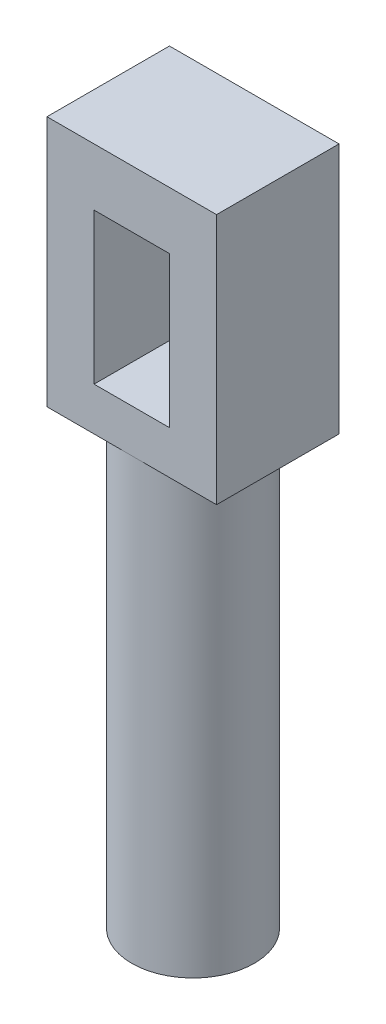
from build123d import *

# Parameters (mm, degrees)
SKETCH1_R           = 9.75
BOSS_EXTRUDE1_DEPTH = 70
SKETCH3_W           = 27
SKETCH3_H           = 19.5
BOSS_EXTRUDE3_DEPTH = 40
SKETCH4_W           = 12
SKETCH4_H           = 24
CUT_EXTRUDE1_DEPTH  = 40


with BuildPart() as part:
    # Sketch1 → Boss-Extrude1 (new body)
    with BuildSketch(Plane(origin=(0, 0, 0), x_dir=(1, 0, 0), z_dir=(0, 1, 0))):
        with Locations(Location((0, 0, 0), (0, 0, 270))):
            Circle(SKETCH1_R)
    extrude(amount=BOSS_EXTRUDE1_DEPTH)

    # Sketch3 → Boss-Extrude3 (add)
    with BuildSketch(Plane(origin=(0, 70, 0), x_dir=(1, 0, 0), z_dir=(0, 1, 0))):
        Rectangle(SKETCH3_W, SKETCH3_H)
    extrude(amount=BOSS_EXTRUDE3_DEPTH)

    # Sketch4 → Cut-Extrude1 (cut)
    with BuildSketch(Plane(origin=(0, 0, -9.75), x_dir=(-1, 0, 0), z_dir=(0, 0, -1))):
        with Locations((0, 88.875497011)):
            Rectangle(SKETCH4_W, SKETCH4_H)
    extrude(amount=-CUT_EXTRUDE1_DEPTH, mode=Mode.SUBTRACT)


solid = part.part
